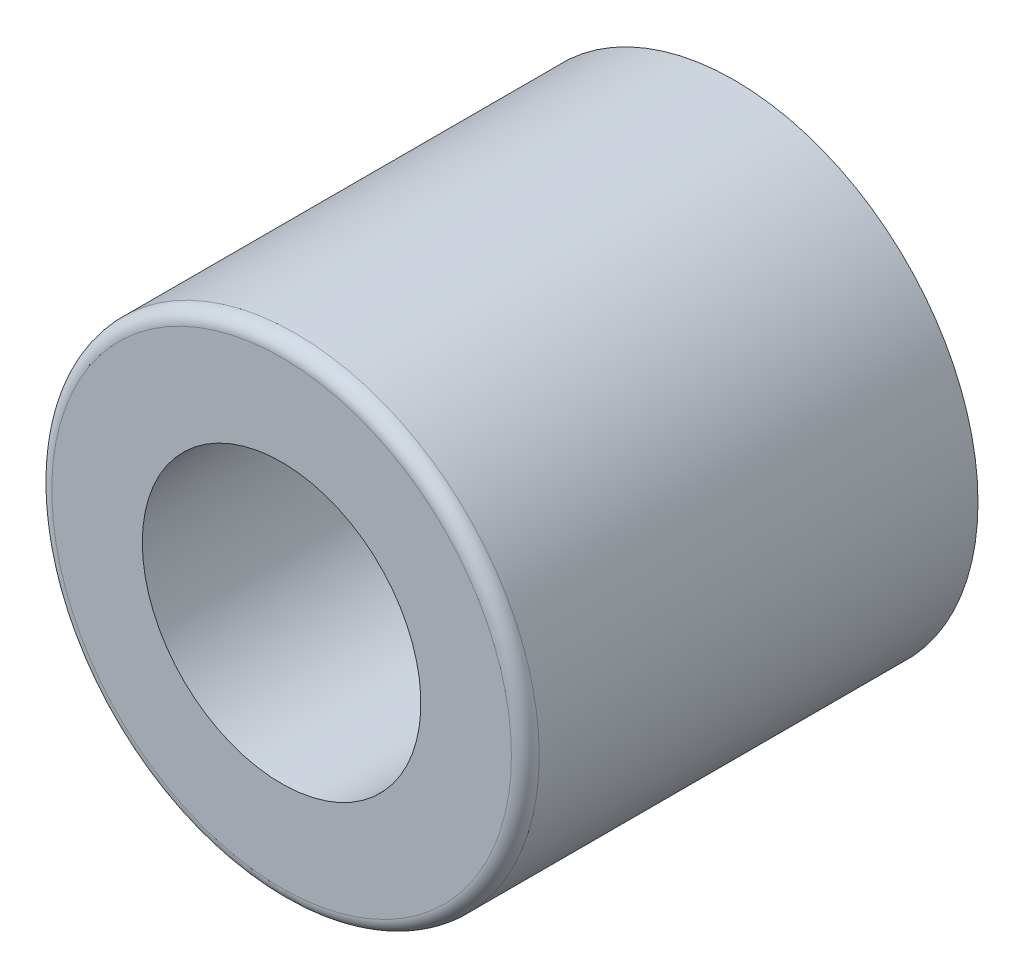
from build123d import *

# Parameters (mm, degrees)
ESQUISSE2_R          = 3.5
ESQUISSE2_R_2        = 2
BASE_EXTRUSION_DEPTH = 6.5
CONG_1_R             = 0.2


with BuildPart() as part:
    # Esquisse2 → Base-Extrusion (new body)
    with BuildSketch(Plane.XY):
        with Locations(Location((0, 0, 0), (0, 0, 180))):
            Circle(ESQUISSE2_R)
        with Locations(Location((0, 0, 0), (0, 0, 180))):
            Circle(ESQUISSE2_R_2, mode=Mode.SUBTRACT)
    extrude(amount=BASE_EXTRUSION_DEPTH)

    # Cong_1
    cong_1_edges = [part.edges().sort_by_distance(p)[0] for p in [
        (3.5, 0, 6.5),
    ]]
    fillet(cong_1_edges, radius=CONG_1_R)


solid = part.part
